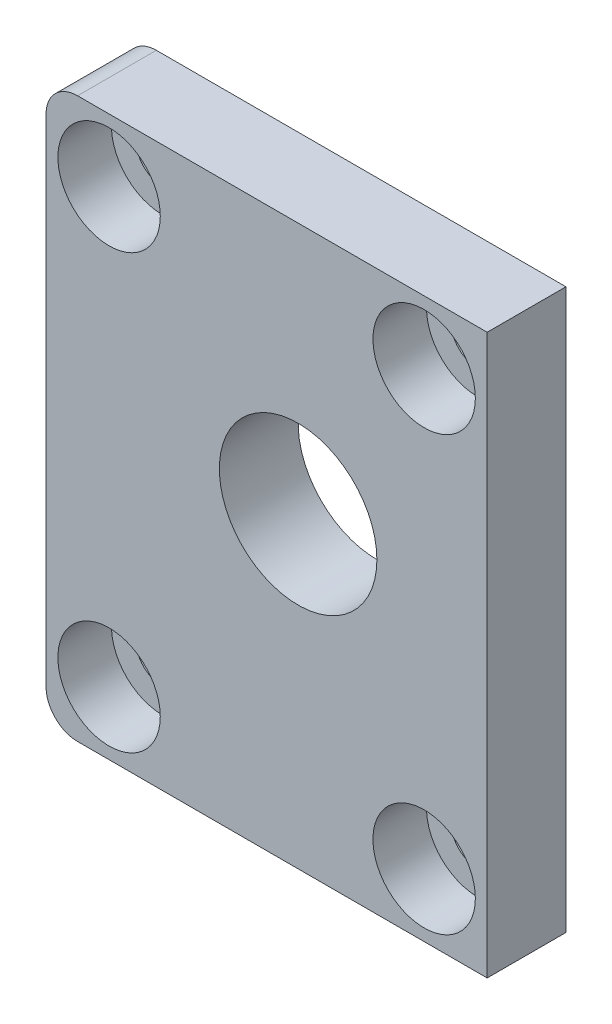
ISO-10303-21;
HEADER;
FILE_DESCRIPTION(('STEP AP214'),'2;1');
FILE_NAME('part.step','',(''),(''),'','','');
FILE_SCHEMA(('AUTOMOTIVE_DESIGN { 1 0 10303 214 1 1 1 1 }'));
ENDSEC;
DATA;
#1=APPLICATION_CONTEXT('core data for automotive mechanical design processes');
#2=APPLICATION_PROTOCOL_DEFINITION('international standard','automotive_design',2000,#1);
#3=PRODUCT_CONTEXT('',#1,'mechanical');
#4=PRODUCT('Part','Part','',(#3));
#5=PRODUCT_RELATED_PRODUCT_CATEGORY('part','',(#4));
#6=PRODUCT_DEFINITION_FORMATION('','',#4);
#7=PRODUCT_DEFINITION_CONTEXT('part definition',#1,'design');
#8=PRODUCT_DEFINITION('design','',#6,#7);
#9=PRODUCT_DEFINITION_SHAPE('','',#8);
#10=(LENGTH_UNIT() NAMED_UNIT(*) SI_UNIT(.MILLI.,.METRE.));
#11=(NAMED_UNIT(*) PLANE_ANGLE_UNIT() SI_UNIT($,.RADIAN.));
#12=(NAMED_UNIT(*) SI_UNIT($,.STERADIAN.) SOLID_ANGLE_UNIT());
#13=UNCERTAINTY_MEASURE_WITH_UNIT(LENGTH_MEASURE(1.E-05),#10,'distance_accuracy_value','');
#14=(GEOMETRIC_REPRESENTATION_CONTEXT(3) GLOBAL_UNCERTAINTY_ASSIGNED_CONTEXT((#13)) GLOBAL_UNIT_ASSIGNED_CONTEXT((#10,
#11,#12)) REPRESENTATION_CONTEXT('',''));
#15=CARTESIAN_POINT('',(0.,0.,0.));
#16=DIRECTION('',(0.,0.,1.));
#17=DIRECTION('',(1.,0.,0.));
#18=AXIS2_PLACEMENT_3D('',#15,#16,#17);
#19=CARTESIAN_POINT('',(0.,0.,5.));
#20=DIRECTION('',(0.,0.,-1.));
#21=DIRECTION('',(-1.,0.,0.));
#22=AXIS2_PLACEMENT_3D('',#19,#20,#21);
#23=PLANE('',#22);
#24=CARTESIAN_POINT('',(-10.,13.75,5.));
#25=DIRECTION('',(0.,0.,1.));
#26=DIRECTION('',(1.,0.,0.));
#27=AXIS2_PLACEMENT_3D('',#24,#25,#26);
#28=CIRCLE('',#27,3.25);
#29=CARTESIAN_POINT('',(-6.75,13.75,5.));
#30=VERTEX_POINT('',#29);
#31=EDGE_CURVE('E240',#30,#30,#28,.T.);
#32=ORIENTED_EDGE('',*,*,#31,.F.);
#33=EDGE_LOOP('',(#32));
#34=FACE_BOUND('',#33,.T.);
#35=CARTESIAN_POINT('',(10.,13.75,5.));
#36=DIRECTION('',(0.,0.,1.));
#37=DIRECTION('',(1.,0.,0.));
#38=AXIS2_PLACEMENT_3D('',#35,#36,#37);
#39=CIRCLE('',#38,3.25);
#40=CARTESIAN_POINT('',(13.25,13.75,5.));
#41=VERTEX_POINT('',#40);
#42=EDGE_CURVE('E224',#41,#41,#39,.T.);
#43=ORIENTED_EDGE('',*,*,#42,.F.);
#44=EDGE_LOOP('',(#43));
#45=FACE_BOUND('',#44,.T.);
#46=CARTESIAN_POINT('',(10.,-13.75,5.));
#47=DIRECTION('',(0.,0.,1.));
#48=DIRECTION('',(1.,0.,0.));
#49=AXIS2_PLACEMENT_3D('',#46,#47,#48);
#50=CIRCLE('',#49,3.25);
#51=CARTESIAN_POINT('',(13.25,-13.75,5.));
#52=VERTEX_POINT('',#51);
#53=EDGE_CURVE('E208',#52,#52,#50,.T.);
#54=ORIENTED_EDGE('',*,*,#53,.F.);
#55=EDGE_LOOP('',(#54));
#56=FACE_BOUND('',#55,.T.);
#57=CARTESIAN_POINT('',(-10.,-13.75,5.));
#58=DIRECTION('',(0.,0.,1.));
#59=DIRECTION('',(1.,0.,0.));
#60=AXIS2_PLACEMENT_3D('',#57,#58,#59);
#61=CIRCLE('',#60,3.25);
#62=CARTESIAN_POINT('',(-6.75,-13.75,5.));
#63=VERTEX_POINT('',#62);
#64=EDGE_CURVE('E192',#63,#63,#61,.T.);
#65=ORIENTED_EDGE('',*,*,#64,.F.);
#66=EDGE_LOOP('',(#65));
#67=FACE_BOUND('',#66,.T.);
#68=DIRECTION('',(0.,-1.,0.));
#69=VECTOR('',#68,1.);
#70=CARTESIAN_POINT('',(-14.,-17.75,5.));
#71=LINE('',#70,#69);
#72=CARTESIAN_POINT('',(-14.,15.75,5.));
#73=VERTEX_POINT('',#72);
#74=CARTESIAN_POINT('',(-14.,-15.75,5.));
#75=VERTEX_POINT('',#74);
#76=EDGE_CURVE('E100',#73,#75,#71,.T.);
#77=ORIENTED_EDGE('',*,*,#76,.T.);
#78=CARTESIAN_POINT('',(-12.,-15.75,5.));
#79=DIRECTION('',(0.,0.,-1.));
#80=DIRECTION('',(-1.,0.,0.));
#81=AXIS2_PLACEMENT_3D('',#78,#79,#80);
#82=CIRCLE('',#81,2.);
#83=CARTESIAN_POINT('',(-12.,-17.75,5.));
#84=VERTEX_POINT('',#83);
#85=EDGE_CURVE('E47',#75,#84,#82,.F.);
#86=ORIENTED_EDGE('',*,*,#85,.T.);
#87=DIRECTION('',(1.,0.,0.));
#88=VECTOR('',#87,1.);
#89=CARTESIAN_POINT('',(-14.,-17.75,5.));
#90=LINE('',#89,#88);
#91=CARTESIAN_POINT('',(14.,-17.75,5.));
#92=VERTEX_POINT('',#91);
#93=EDGE_CURVE('E106',#84,#92,#90,.T.);
#94=ORIENTED_EDGE('',*,*,#93,.T.);
#95=DIRECTION('',(0.,1.,0.));
#96=VECTOR('',#95,1.);
#97=CARTESIAN_POINT('',(14.,-17.75,5.));
#98=LINE('',#97,#96);
#99=CARTESIAN_POINT('',(14.,17.75,5.));
#100=VERTEX_POINT('',#99);
#101=EDGE_CURVE('E101',#92,#100,#98,.T.);
#102=ORIENTED_EDGE('',*,*,#101,.T.);
#103=DIRECTION('',(-1.,0.,0.));
#104=VECTOR('',#103,1.);
#105=CARTESIAN_POINT('',(-14.,17.75,5.));
#106=LINE('',#105,#104);
#107=CARTESIAN_POINT('',(-12.,17.75,5.));
#108=VERTEX_POINT('',#107);
#109=EDGE_CURVE('E91',#100,#108,#106,.T.);
#110=ORIENTED_EDGE('',*,*,#109,.T.);
#111=CARTESIAN_POINT('',(-12.,15.75,5.));
#112=DIRECTION('',(0.,0.,-1.));
#113=DIRECTION('',(-1.,0.,0.));
#114=AXIS2_PLACEMENT_3D('',#111,#112,#113);
#115=CIRCLE('',#114,2.);
#116=EDGE_CURVE('E140',#108,#73,#115,.F.);
#117=ORIENTED_EDGE('',*,*,#116,.T.);
#118=EDGE_LOOP('',(#77,#86,#94,#102,#110,#117));
#119=FACE_BOUND('',#118,.T.);
#120=CARTESIAN_POINT('',(2.,1.75,5.));
#121=DIRECTION('',(0.,0.,1.));
#122=DIRECTION('',(1.,0.,0.));
#123=AXIS2_PLACEMENT_3D('',#120,#121,#122);
#124=CIRCLE('',#123,5.);
#125=CARTESIAN_POINT('',(7.00000000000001,1.75,5.));
#126=VERTEX_POINT('',#125);
#127=EDGE_CURVE('E169',#126,#126,#124,.T.);
#128=ORIENTED_EDGE('',*,*,#127,.F.);
#129=EDGE_LOOP('',(#128));
#130=FACE_BOUND('',#129,.T.);
#131=ADVANCED_FACE('F38',(#34,#45,#56,#67,#119,#130),#23,.F.);
#132=CARTESIAN_POINT('',(0.,0.,0.));
#133=DIRECTION('',(0.,0.,-1.));
#134=DIRECTION('',(-1.,0.,0.));
#135=AXIS2_PLACEMENT_3D('',#132,#133,#134);
#136=PLANE('',#135);
#137=CARTESIAN_POINT('',(-10.,13.75,0.));
#138=DIRECTION('',(0.,0.,1.));
#139=DIRECTION('',(1.,0.,0.));
#140=AXIS2_PLACEMENT_3D('',#137,#138,#139);
#141=CIRCLE('',#140,1.7);
#142=CARTESIAN_POINT('',(-8.3,13.75,0.));
#143=VERTEX_POINT('',#142);
#144=EDGE_CURVE('E228',#143,#143,#141,.T.);
#145=ORIENTED_EDGE('',*,*,#144,.T.);
#146=EDGE_LOOP('',(#145));
#147=FACE_BOUND('',#146,.T.);
#148=CARTESIAN_POINT('',(10.,13.75,0.));
#149=DIRECTION('',(0.,0.,1.));
#150=DIRECTION('',(1.,0.,0.));
#151=AXIS2_PLACEMENT_3D('',#148,#149,#150);
#152=CIRCLE('',#151,1.7);
#153=CARTESIAN_POINT('',(11.7,13.75,0.));
#154=VERTEX_POINT('',#153);
#155=EDGE_CURVE('E212',#154,#154,#152,.T.);
#156=ORIENTED_EDGE('',*,*,#155,.T.);
#157=EDGE_LOOP('',(#156));
#158=FACE_BOUND('',#157,.T.);
#159=CARTESIAN_POINT('',(10.,-13.75,0.));
#160=DIRECTION('',(0.,0.,1.));
#161=DIRECTION('',(1.,0.,0.));
#162=AXIS2_PLACEMENT_3D('',#159,#160,#161);
#163=CIRCLE('',#162,1.7);
#164=CARTESIAN_POINT('',(11.7,-13.75,0.));
#165=VERTEX_POINT('',#164);
#166=EDGE_CURVE('E196',#165,#165,#163,.T.);
#167=ORIENTED_EDGE('',*,*,#166,.T.);
#168=EDGE_LOOP('',(#167));
#169=FACE_BOUND('',#168,.T.);
#170=CARTESIAN_POINT('',(-10.,-13.75,0.));
#171=DIRECTION('',(0.,0.,1.));
#172=DIRECTION('',(1.,0.,0.));
#173=AXIS2_PLACEMENT_3D('',#170,#171,#172);
#174=CIRCLE('',#173,1.7);
#175=CARTESIAN_POINT('',(-8.3,-13.75,0.));
#176=VERTEX_POINT('',#175);
#177=EDGE_CURVE('E177',#176,#176,#174,.T.);
#178=ORIENTED_EDGE('',*,*,#177,.T.);
#179=EDGE_LOOP('',(#178));
#180=FACE_BOUND('',#179,.T.);
#181=DIRECTION('',(1.,0.,0.));
#182=VECTOR('',#181,1.);
#183=CARTESIAN_POINT('',(-14.,-17.75,0.));
#184=LINE('',#183,#182);
#185=CARTESIAN_POINT('',(-12.,-17.75,0.));
#186=VERTEX_POINT('',#185);
#187=CARTESIAN_POINT('',(14.,-17.75,0.));
#188=VERTEX_POINT('',#187);
#189=EDGE_CURVE('E111',#186,#188,#184,.T.);
#190=ORIENTED_EDGE('',*,*,#189,.F.);
#191=CARTESIAN_POINT('',(-12.,-15.75,0.));
#192=DIRECTION('',(0.,0.,-1.));
#193=DIRECTION('',(-1.,0.,0.));
#194=AXIS2_PLACEMENT_3D('',#191,#192,#193);
#195=CIRCLE('',#194,2.);
#196=CARTESIAN_POINT('',(-14.,-15.75,0.));
#197=VERTEX_POINT('',#196);
#198=EDGE_CURVE('E131',#186,#197,#195,.T.);
#199=ORIENTED_EDGE('',*,*,#198,.T.);
#200=DIRECTION('',(0.,-1.,0.));
#201=VECTOR('',#200,1.);
#202=CARTESIAN_POINT('',(-14.,-17.75,0.));
#203=LINE('',#202,#201);
#204=CARTESIAN_POINT('',(-14.,15.75,0.));
#205=VERTEX_POINT('',#204);
#206=EDGE_CURVE('E157',#205,#197,#203,.T.);
#207=ORIENTED_EDGE('',*,*,#206,.F.);
#208=CARTESIAN_POINT('',(-12.,15.75,0.));
#209=DIRECTION('',(0.,0.,-1.));
#210=DIRECTION('',(-1.,0.,0.));
#211=AXIS2_PLACEMENT_3D('',#208,#209,#210);
#212=CIRCLE('',#211,2.);
#213=CARTESIAN_POINT('',(-12.,17.75,0.));
#214=VERTEX_POINT('',#213);
#215=EDGE_CURVE('E124',#205,#214,#212,.T.);
#216=ORIENTED_EDGE('',*,*,#215,.T.);
#217=DIRECTION('',(-1.,0.,0.));
#218=VECTOR('',#217,1.);
#219=CARTESIAN_POINT('',(-14.,17.75,0.));
#220=LINE('',#219,#218);
#221=CARTESIAN_POINT('',(14.,17.75,0.));
#222=VERTEX_POINT('',#221);
#223=EDGE_CURVE('E161',#222,#214,#220,.T.);
#224=ORIENTED_EDGE('',*,*,#223,.F.);
#225=DIRECTION('',(0.,1.,0.));
#226=VECTOR('',#225,1.);
#227=CARTESIAN_POINT('',(14.,-17.75,0.));
#228=LINE('',#227,#226);
#229=EDGE_CURVE('E115',#188,#222,#228,.T.);
#230=ORIENTED_EDGE('',*,*,#229,.F.);
#231=EDGE_LOOP('',(#190,#199,#207,#216,#224,#230));
#232=FACE_BOUND('',#231,.T.);
#233=CARTESIAN_POINT('',(2.,1.75,0.));
#234=DIRECTION('',(0.,0.,1.));
#235=DIRECTION('',(1.,0.,0.));
#236=AXIS2_PLACEMENT_3D('',#233,#234,#235);
#237=CIRCLE('',#236,5.);
#238=CARTESIAN_POINT('',(7.00000000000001,1.75,0.));
#239=VERTEX_POINT('',#238);
#240=EDGE_CURVE('E173',#239,#239,#237,.T.);
#241=ORIENTED_EDGE('',*,*,#240,.T.);
#242=EDGE_LOOP('',(#241));
#243=FACE_BOUND('',#242,.T.);
#244=ADVANCED_FACE('F155',(#147,#158,#169,#180,#232,#243),#136,.T.);
#245=CARTESIAN_POINT('',(14.,-17.75,5.));
#246=DIRECTION('',(-1.,0.,0.));
#247=DIRECTION('',(0.,0.,1.));
#248=AXIS2_PLACEMENT_3D('',#245,#246,#247);
#249=PLANE('',#248);
#250=ORIENTED_EDGE('',*,*,#229,.T.);
#251=DIRECTION('',(0.,0.,-1.));
#252=VECTOR('',#251,1.);
#253=CARTESIAN_POINT('',(14.,17.75,5.));
#254=LINE('',#253,#252);
#255=EDGE_CURVE('E95',#100,#222,#254,.T.);
#256=ORIENTED_EDGE('',*,*,#255,.F.);
#257=ORIENTED_EDGE('',*,*,#101,.F.);
#258=DIRECTION('',(0.,0.,-1.));
#259=VECTOR('',#258,1.);
#260=CARTESIAN_POINT('',(14.,-17.75,5.));
#261=LINE('',#260,#259);
#262=EDGE_CURVE('E118',#92,#188,#261,.T.);
#263=ORIENTED_EDGE('',*,*,#262,.T.);
#264=EDGE_LOOP('',(#250,#256,#257,#263));
#265=FACE_BOUND('',#264,.T.);
#266=ADVANCED_FACE('F113',(#265),#249,.F.);
#267=CARTESIAN_POINT('',(-14.,17.75,5.));
#268=DIRECTION('',(0.,-1.,0.));
#269=DIRECTION('',(0.,0.,-1.));
#270=AXIS2_PLACEMENT_3D('',#267,#268,#269);
#271=PLANE('',#270);
#272=ORIENTED_EDGE('',*,*,#223,.T.);
#273=DIRECTION('',(0.,0.,-1.));
#274=VECTOR('',#273,1.);
#275=CARTESIAN_POINT('',(-12.,17.75,5.));
#276=LINE('',#275,#274);
#277=EDGE_CURVE('E11',#214,#108,#276,.F.);
#278=ORIENTED_EDGE('',*,*,#277,.T.);
#279=ORIENTED_EDGE('',*,*,#109,.F.);
#280=ORIENTED_EDGE('',*,*,#255,.T.);
#281=EDGE_LOOP('',(#272,#278,#279,#280));
#282=FACE_BOUND('',#281,.T.);
#283=ADVANCED_FACE('F93',(#282),#271,.F.);
#284=CARTESIAN_POINT('',(-14.,-17.75,5.));
#285=DIRECTION('',(1.,0.,0.));
#286=DIRECTION('',(0.,0.,-1.));
#287=AXIS2_PLACEMENT_3D('',#284,#285,#286);
#288=PLANE('',#287);
#289=ORIENTED_EDGE('',*,*,#206,.T.);
#290=DIRECTION('',(0.,0.,-1.));
#291=VECTOR('',#290,1.);
#292=CARTESIAN_POINT('',(-14.,-15.75,5.));
#293=LINE('',#292,#291);
#294=EDGE_CURVE('E60',#197,#75,#293,.F.);
#295=ORIENTED_EDGE('',*,*,#294,.T.);
#296=ORIENTED_EDGE('',*,*,#76,.F.);
#297=DIRECTION('',(0.,0.,-1.));
#298=VECTOR('',#297,1.);
#299=CARTESIAN_POINT('',(-14.,15.75,5.));
#300=LINE('',#299,#298);
#301=EDGE_CURVE('E134',#73,#205,#300,.T.);
#302=ORIENTED_EDGE('',*,*,#301,.T.);
#303=EDGE_LOOP('',(#289,#295,#296,#302));
#304=FACE_BOUND('',#303,.T.);
#305=ADVANCED_FACE('F158',(#304),#288,.F.);
#306=CARTESIAN_POINT('',(-14.,-17.75,5.));
#307=DIRECTION('',(0.,1.,0.));
#308=DIRECTION('',(0.,0.,1.));
#309=AXIS2_PLACEMENT_3D('',#306,#307,#308);
#310=PLANE('',#309);
#311=ORIENTED_EDGE('',*,*,#93,.F.);
#312=DIRECTION('',(0.,0.,-1.));
#313=VECTOR('',#312,1.);
#314=CARTESIAN_POINT('',(-12.,-17.75,5.));
#315=LINE('',#314,#313);
#316=EDGE_CURVE('E117',#84,#186,#315,.T.);
#317=ORIENTED_EDGE('',*,*,#316,.T.);
#318=ORIENTED_EDGE('',*,*,#189,.T.);
#319=ORIENTED_EDGE('',*,*,#262,.F.);
#320=EDGE_LOOP('',(#311,#317,#318,#319));
#321=FACE_BOUND('',#320,.T.);
#322=ADVANCED_FACE('F148',(#321),#310,.F.);
#323=CARTESIAN_POINT('',(2.,1.75,5.));
#324=DIRECTION('',(0.,0.,-1.));
#325=DIRECTION('',(-1.,0.,0.));
#326=AXIS2_PLACEMENT_3D('',#323,#324,#325);
#327=CYLINDRICAL_SURFACE('',#326,5.);
#328=ORIENTED_EDGE('',*,*,#127,.T.);
#329=EDGE_LOOP('',(#328));
#330=FACE_BOUND('',#329,.T.);
#331=ORIENTED_EDGE('',*,*,#240,.F.);
#332=EDGE_LOOP('',(#331));
#333=FACE_BOUND('',#332,.T.);
#334=ADVANCED_FACE('F278',(#330,#333),#327,.F.);
#335=CARTESIAN_POINT('',(-10.,-13.75,5.));
#336=DIRECTION('',(0.,0.,1.));
#337=DIRECTION('',(1.,0.,0.));
#338=AXIS2_PLACEMENT_3D('',#335,#336,#337);
#339=CYLINDRICAL_SURFACE('',#338,1.70000000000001);
#340=ORIENTED_EDGE('',*,*,#177,.F.);
#341=EDGE_LOOP('',(#340));
#342=FACE_BOUND('',#341,.T.);
#343=CARTESIAN_POINT('',(-10.,-13.75,1.6));
#344=DIRECTION('',(0.,0.,1.));
#345=DIRECTION('',(1.,0.,0.));
#346=AXIS2_PLACEMENT_3D('',#343,#344,#345);
#347=CIRCLE('',#346,1.70000000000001);
#348=CARTESIAN_POINT('',(-8.29999999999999,-13.75,1.6));
#349=VERTEX_POINT('',#348);
#350=EDGE_CURVE('E184',#349,#349,#347,.T.);
#351=ORIENTED_EDGE('',*,*,#350,.T.);
#352=EDGE_LOOP('',(#351));
#353=FACE_BOUND('',#352,.T.);
#354=ADVANCED_FACE('F270',(#342,#353),#339,.F.);
#355=CARTESIAN_POINT('',(-8.29999999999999,-13.75,1.6));
#356=DIRECTION('',(0.,0.,-1.));
#357=DIRECTION('',(-1.,0.,0.));
#358=AXIS2_PLACEMENT_3D('',#355,#356,#357);
#359=PLANE('',#358);
#360=ORIENTED_EDGE('',*,*,#350,.F.);
#361=EDGE_LOOP('',(#360));
#362=FACE_BOUND('',#361,.T.);
#363=CARTESIAN_POINT('',(-10.,-13.75,1.6));
#364=DIRECTION('',(0.,0.,1.));
#365=DIRECTION('',(1.,0.,0.));
#366=AXIS2_PLACEMENT_3D('',#363,#364,#365);
#367=CIRCLE('',#366,3.25);
#368=CARTESIAN_POINT('',(-6.75,-13.75,1.6));
#369=VERTEX_POINT('',#368);
#370=EDGE_CURVE('E188',#369,#369,#367,.T.);
#371=ORIENTED_EDGE('',*,*,#370,.T.);
#372=EDGE_LOOP('',(#371));
#373=FACE_BOUND('',#372,.T.);
#374=ADVANCED_FACE('F260',(#362,#373),#359,.F.);
#375=CARTESIAN_POINT('',(-10.,-13.75,5.));
#376=DIRECTION('',(0.,0.,1.));
#377=DIRECTION('',(1.,0.,0.));
#378=AXIS2_PLACEMENT_3D('',#375,#376,#377);
#379=CYLINDRICAL_SURFACE('',#378,3.25);
#380=ORIENTED_EDGE('',*,*,#370,.F.);
#381=EDGE_LOOP('',(#380));
#382=FACE_BOUND('',#381,.T.);
#383=ORIENTED_EDGE('',*,*,#64,.T.);
#384=EDGE_LOOP('',(#383));
#385=FACE_BOUND('',#384,.T.);
#386=ADVANCED_FACE('F257',(#382,#385),#379,.F.);
#387=CARTESIAN_POINT('',(10.,-13.75,5.));
#388=DIRECTION('',(0.,0.,1.));
#389=DIRECTION('',(1.,0.,0.));
#390=AXIS2_PLACEMENT_3D('',#387,#388,#389);
#391=CYLINDRICAL_SURFACE('',#390,1.70000000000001);
#392=ORIENTED_EDGE('',*,*,#166,.F.);
#393=EDGE_LOOP('',(#392));
#394=FACE_BOUND('',#393,.T.);
#395=CARTESIAN_POINT('',(10.,-13.75,1.6));
#396=DIRECTION('',(0.,0.,1.));
#397=DIRECTION('',(1.,0.,0.));
#398=AXIS2_PLACEMENT_3D('',#395,#396,#397);
#399=CIRCLE('',#398,1.70000000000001);
#400=CARTESIAN_POINT('',(11.7,-13.75,1.6));
#401=VERTEX_POINT('',#400);
#402=EDGE_CURVE('E200',#401,#401,#399,.T.);
#403=ORIENTED_EDGE('',*,*,#402,.T.);
#404=EDGE_LOOP('',(#403));
#405=FACE_BOUND('',#404,.T.);
#406=ADVANCED_FACE('F259',(#394,#405),#391,.F.);
#407=CARTESIAN_POINT('',(11.7,-13.75,1.6));
#408=DIRECTION('',(0.,0.,-1.));
#409=DIRECTION('',(-1.,0.,0.));
#410=AXIS2_PLACEMENT_3D('',#407,#408,#409);
#411=PLANE('',#410);
#412=ORIENTED_EDGE('',*,*,#402,.F.);
#413=EDGE_LOOP('',(#412));
#414=FACE_BOUND('',#413,.T.);
#415=CARTESIAN_POINT('',(10.,-13.75,1.6));
#416=DIRECTION('',(0.,0.,1.));
#417=DIRECTION('',(1.,0.,0.));
#418=AXIS2_PLACEMENT_3D('',#415,#416,#417);
#419=CIRCLE('',#418,3.25);
#420=CARTESIAN_POINT('',(13.25,-13.75,1.6));
#421=VERTEX_POINT('',#420);
#422=EDGE_CURVE('E204',#421,#421,#419,.T.);
#423=ORIENTED_EDGE('',*,*,#422,.T.);
#424=EDGE_LOOP('',(#423));
#425=FACE_BOUND('',#424,.T.);
#426=ADVANCED_FACE('F267',(#414,#425),#411,.F.);
#427=CARTESIAN_POINT('',(10.,-13.75,5.));
#428=DIRECTION('',(0.,0.,1.));
#429=DIRECTION('',(1.,0.,0.));
#430=AXIS2_PLACEMENT_3D('',#427,#428,#429);
#431=CYLINDRICAL_SURFACE('',#430,3.25);
#432=ORIENTED_EDGE('',*,*,#422,.F.);
#433=EDGE_LOOP('',(#432));
#434=FACE_BOUND('',#433,.T.);
#435=ORIENTED_EDGE('',*,*,#53,.T.);
#436=EDGE_LOOP('',(#435));
#437=FACE_BOUND('',#436,.T.);
#438=ADVANCED_FACE('F324',(#434,#437),#431,.F.);
#439=CARTESIAN_POINT('',(10.,13.75,5.));
#440=DIRECTION('',(0.,0.,1.));
#441=DIRECTION('',(1.,0.,0.));
#442=AXIS2_PLACEMENT_3D('',#439,#440,#441);
#443=CYLINDRICAL_SURFACE('',#442,1.70000000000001);
#444=ORIENTED_EDGE('',*,*,#155,.F.);
#445=EDGE_LOOP('',(#444));
#446=FACE_BOUND('',#445,.T.);
#447=CARTESIAN_POINT('',(10.,13.75,1.6));
#448=DIRECTION('',(0.,0.,1.));
#449=DIRECTION('',(1.,0.,0.));
#450=AXIS2_PLACEMENT_3D('',#447,#448,#449);
#451=CIRCLE('',#450,1.70000000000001);
#452=CARTESIAN_POINT('',(11.7,13.75,1.6));
#453=VERTEX_POINT('',#452);
#454=EDGE_CURVE('E216',#453,#453,#451,.T.);
#455=ORIENTED_EDGE('',*,*,#454,.T.);
#456=EDGE_LOOP('',(#455));
#457=FACE_BOUND('',#456,.T.);
#458=ADVANCED_FACE('F320',(#446,#457),#443,.F.);
#459=CARTESIAN_POINT('',(11.7,13.75,1.6));
#460=DIRECTION('',(0.,0.,-1.));
#461=DIRECTION('',(-1.,0.,0.));
#462=AXIS2_PLACEMENT_3D('',#459,#460,#461);
#463=PLANE('',#462);
#464=ORIENTED_EDGE('',*,*,#454,.F.);
#465=EDGE_LOOP('',(#464));
#466=FACE_BOUND('',#465,.T.);
#467=CARTESIAN_POINT('',(10.,13.75,1.6));
#468=DIRECTION('',(0.,0.,1.));
#469=DIRECTION('',(1.,0.,0.));
#470=AXIS2_PLACEMENT_3D('',#467,#468,#469);
#471=CIRCLE('',#470,3.25);
#472=CARTESIAN_POINT('',(13.25,13.75,1.6));
#473=VERTEX_POINT('',#472);
#474=EDGE_CURVE('E220',#473,#473,#471,.T.);
#475=ORIENTED_EDGE('',*,*,#474,.T.);
#476=EDGE_LOOP('',(#475));
#477=FACE_BOUND('',#476,.T.);
#478=ADVANCED_FACE('F316',(#466,#477),#463,.F.);
#479=CARTESIAN_POINT('',(10.,13.75,5.));
#480=DIRECTION('',(0.,0.,1.));
#481=DIRECTION('',(1.,0.,0.));
#482=AXIS2_PLACEMENT_3D('',#479,#480,#481);
#483=CYLINDRICAL_SURFACE('',#482,3.25);
#484=ORIENTED_EDGE('',*,*,#474,.F.);
#485=EDGE_LOOP('',(#484));
#486=FACE_BOUND('',#485,.T.);
#487=ORIENTED_EDGE('',*,*,#42,.T.);
#488=EDGE_LOOP('',(#487));
#489=FACE_BOUND('',#488,.T.);
#490=ADVANCED_FACE('F312',(#486,#489),#483,.F.);
#491=CARTESIAN_POINT('',(-10.,13.75,5.));
#492=DIRECTION('',(0.,0.,1.));
#493=DIRECTION('',(1.,0.,0.));
#494=AXIS2_PLACEMENT_3D('',#491,#492,#493);
#495=CYLINDRICAL_SURFACE('',#494,1.70000000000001);
#496=ORIENTED_EDGE('',*,*,#144,.F.);
#497=EDGE_LOOP('',(#496));
#498=FACE_BOUND('',#497,.T.);
#499=CARTESIAN_POINT('',(-10.,13.75,1.6));
#500=DIRECTION('',(0.,0.,1.));
#501=DIRECTION('',(1.,0.,0.));
#502=AXIS2_PLACEMENT_3D('',#499,#500,#501);
#503=CIRCLE('',#502,1.70000000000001);
#504=CARTESIAN_POINT('',(-8.29999999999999,13.75,1.6));
#505=VERTEX_POINT('',#504);
#506=EDGE_CURVE('E232',#505,#505,#503,.T.);
#507=ORIENTED_EDGE('',*,*,#506,.T.);
#508=EDGE_LOOP('',(#507));
#509=FACE_BOUND('',#508,.T.);
#510=ADVANCED_FACE('F305',(#498,#509),#495,.F.);
#511=CARTESIAN_POINT('',(-8.29999999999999,13.75,1.6));
#512=DIRECTION('',(0.,0.,-1.));
#513=DIRECTION('',(-1.,0.,0.));
#514=AXIS2_PLACEMENT_3D('',#511,#512,#513);
#515=PLANE('',#514);
#516=ORIENTED_EDGE('',*,*,#506,.F.);
#517=EDGE_LOOP('',(#516));
#518=FACE_BOUND('',#517,.T.);
#519=CARTESIAN_POINT('',(-10.,13.75,1.6));
#520=DIRECTION('',(0.,0.,1.));
#521=DIRECTION('',(1.,0.,0.));
#522=AXIS2_PLACEMENT_3D('',#519,#520,#521);
#523=CIRCLE('',#522,3.25);
#524=CARTESIAN_POINT('',(-6.75,13.75,1.6));
#525=VERTEX_POINT('',#524);
#526=EDGE_CURVE('E236',#525,#525,#523,.T.);
#527=ORIENTED_EDGE('',*,*,#526,.T.);
#528=EDGE_LOOP('',(#527));
#529=FACE_BOUND('',#528,.T.);
#530=ADVANCED_FACE('F299',(#518,#529),#515,.F.);
#531=CARTESIAN_POINT('',(-10.,13.75,5.));
#532=DIRECTION('',(0.,0.,1.));
#533=DIRECTION('',(1.,0.,0.));
#534=AXIS2_PLACEMENT_3D('',#531,#532,#533);
#535=CYLINDRICAL_SURFACE('',#534,3.25);
#536=ORIENTED_EDGE('',*,*,#526,.F.);
#537=EDGE_LOOP('',(#536));
#538=FACE_BOUND('',#537,.T.);
#539=ORIENTED_EDGE('',*,*,#31,.T.);
#540=EDGE_LOOP('',(#539));
#541=FACE_BOUND('',#540,.T.);
#542=ADVANCED_FACE('F246',(#538,#541),#535,.F.);
#543=CARTESIAN_POINT('',(-12.,-15.75,5.));
#544=DIRECTION('',(0.,0.,-1.));
#545=DIRECTION('',(-1.,0.,0.));
#546=AXIS2_PLACEMENT_3D('',#543,#544,#545);
#547=CYLINDRICAL_SURFACE('',#546,2.);
#548=ORIENTED_EDGE('',*,*,#85,.F.);
#549=ORIENTED_EDGE('',*,*,#294,.F.);
#550=ORIENTED_EDGE('',*,*,#198,.F.);
#551=ORIENTED_EDGE('',*,*,#316,.F.);
#552=EDGE_LOOP('',(#548,#549,#550,#551));
#553=FACE_BOUND('',#552,.T.);
#554=ADVANCED_FACE('F152',(#553),#547,.T.);
#555=CARTESIAN_POINT('',(-12.,15.75,5.));
#556=DIRECTION('',(0.,0.,-1.));
#557=DIRECTION('',(-1.,0.,0.));
#558=AXIS2_PLACEMENT_3D('',#555,#556,#557);
#559=CYLINDRICAL_SURFACE('',#558,2.);
#560=ORIENTED_EDGE('',*,*,#116,.F.);
#561=ORIENTED_EDGE('',*,*,#277,.F.);
#562=ORIENTED_EDGE('',*,*,#215,.F.);
#563=ORIENTED_EDGE('',*,*,#301,.F.);
#564=EDGE_LOOP('',(#560,#561,#562,#563));
#565=FACE_BOUND('',#564,.T.);
#566=ADVANCED_FACE('F40',(#565),#559,.T.);
#567=CLOSED_SHELL('',(#131,#244,#266,#283,#305,#322,#334,#354,#374,#386,#406,#426,#438,#458,
#478,#490,#510,#530,#542,#554,#566));
#568=MANIFOLD_SOLID_BREP('B2',#567);
#569=ADVANCED_BREP_SHAPE_REPRESENTATION('',(#18,#568),#14);
#570=SHAPE_DEFINITION_REPRESENTATION(#9,#569);
ENDSEC;
END-ISO-10303-21;
